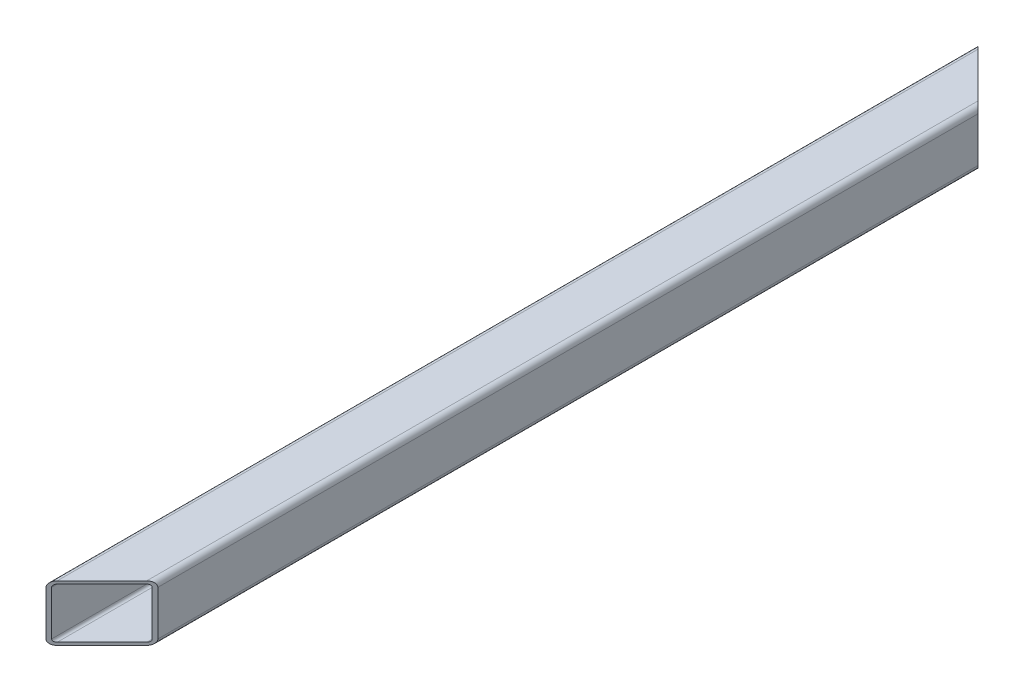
ISO-10303-21;
HEADER;
FILE_DESCRIPTION(('STEP AP214'),'2;1');
FILE_NAME('part.step','',(''),(''),'','','');
FILE_SCHEMA(('AUTOMOTIVE_DESIGN { 1 0 10303 214 1 1 1 1 }'));
ENDSEC;
DATA;
#1=APPLICATION_CONTEXT('core data for automotive mechanical design processes');
#2=APPLICATION_PROTOCOL_DEFINITION('international standard','automotive_design',2000,#1);
#3=PRODUCT_CONTEXT('',#1,'mechanical');
#4=PRODUCT('Part','Part','',(#3));
#5=PRODUCT_RELATED_PRODUCT_CATEGORY('part','',(#4));
#6=PRODUCT_DEFINITION_FORMATION('','',#4);
#7=PRODUCT_DEFINITION_CONTEXT('part definition',#1,'design');
#8=PRODUCT_DEFINITION('design','',#6,#7);
#9=PRODUCT_DEFINITION_SHAPE('','',#8);
#10=(LENGTH_UNIT() NAMED_UNIT(*) SI_UNIT(.MILLI.,.METRE.));
#11=(NAMED_UNIT(*) PLANE_ANGLE_UNIT() SI_UNIT($,.RADIAN.));
#12=(NAMED_UNIT(*) SI_UNIT($,.STERADIAN.) SOLID_ANGLE_UNIT());
#13=UNCERTAINTY_MEASURE_WITH_UNIT(LENGTH_MEASURE(1.E-05),#10,'distance_accuracy_value','');
#14=(GEOMETRIC_REPRESENTATION_CONTEXT(3) GLOBAL_UNCERTAINTY_ASSIGNED_CONTEXT((#13)) GLOBAL_UNIT_ASSIGNED_CONTEXT((#10,
#11,#12)) REPRESENTATION_CONTEXT('',''));
#15=CARTESIAN_POINT('',(0.,0.,0.));
#16=DIRECTION('',(0.,0.,1.));
#17=DIRECTION('',(1.,0.,0.));
#18=AXIS2_PLACEMENT_3D('',#15,#16,#17);
#19=CARTESIAN_POINT('',(6.,-54.,500.));
#20=DIRECTION('',(0.,0.,-1.));
#21=DIRECTION('',(-1.,0.,0.));
#22=AXIS2_PLACEMENT_3D('',#19,#20,#21);
#23=CYLINDRICAL_SURFACE('',#22,6.);
#24=CARTESIAN_POINT('',(6.,-54.,-494.));
#25=DIRECTION('',(0.707106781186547,0.,-0.707106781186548));
#26=DIRECTION('',(-0.707106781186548,0.,-0.707106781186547));
#27=AXIS2_PLACEMENT_3D('',#24,#25,#26);
#28=ELLIPSE('',#27,8.48528137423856,6.);
#29=CARTESIAN_POINT('',(6.00000000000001,-60.,-494.));
#30=VERTEX_POINT('',#29);
#31=CARTESIAN_POINT('',(0.,-54.,-500.));
#32=VERTEX_POINT('',#31);
#33=EDGE_CURVE('E154',#30,#32,#28,.T.);
#34=ORIENTED_EDGE('',*,*,#33,.F.);
#35=DIRECTION('',(0.,0.,-1.));
#36=VECTOR('',#35,1.);
#37=CARTESIAN_POINT('',(6.,-60.,500.));
#38=LINE('',#37,#36);
#39=CARTESIAN_POINT('',(6.,-60.,494.));
#40=VERTEX_POINT('',#39);
#41=EDGE_CURVE('E194',#40,#30,#38,.T.);
#42=ORIENTED_EDGE('',*,*,#41,.F.);
#43=CARTESIAN_POINT('',(6.,-54.,494.));
#44=DIRECTION('',(-0.707106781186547,0.,-0.707106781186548));
#45=DIRECTION('',(0.707106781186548,0.,-0.707106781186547));
#46=AXIS2_PLACEMENT_3D('',#43,#44,#45);
#47=ELLIPSE('',#46,8.48528137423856,6.);
#48=CARTESIAN_POINT('',(-2.22044604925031E-13,-54.,500.));
#49=VERTEX_POINT('',#48);
#50=EDGE_CURVE('E218',#40,#49,#47,.T.);
#51=ORIENTED_EDGE('',*,*,#50,.T.);
#52=DIRECTION('',(0.,0.,-1.));
#53=VECTOR('',#52,1.);
#54=CARTESIAN_POINT('',(0.,-54.,500.));
#55=LINE('',#54,#53);
#56=EDGE_CURVE('E175',#49,#32,#55,.T.);
#57=ORIENTED_EDGE('',*,*,#56,.T.);
#58=EDGE_LOOP('',(#34,#42,#51,#57));
#59=FACE_BOUND('',#58,.T.);
#60=ADVANCED_FACE('F36',(#59),#23,.T.);
#61=CARTESIAN_POINT('',(6.,-60.,500.));
#62=DIRECTION('',(0.,1.,0.));
#63=DIRECTION('',(0.,0.,1.));
#64=AXIS2_PLACEMENT_3D('',#61,#62,#63);
#65=PLANE('',#64);
#66=DIRECTION('',(-0.707106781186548,0.,-0.707106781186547));
#67=VECTOR('',#66,1.);
#68=CARTESIAN_POINT('',(503.,-60.,2.99999999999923));
#69=LINE('',#68,#67);
#70=CARTESIAN_POINT('',(54.,-60.,-446.));
#71=VERTEX_POINT('',#70);
#72=EDGE_CURVE('E263',#71,#30,#69,.T.);
#73=ORIENTED_EDGE('',*,*,#72,.F.);
#74=DIRECTION('',(0.,0.,-1.));
#75=VECTOR('',#74,1.);
#76=CARTESIAN_POINT('',(54.,-60.,500.));
#77=LINE('',#76,#75);
#78=CARTESIAN_POINT('',(54.,-60.,446.));
#79=VERTEX_POINT('',#78);
#80=EDGE_CURVE('E191',#79,#71,#77,.T.);
#81=ORIENTED_EDGE('',*,*,#80,.F.);
#82=DIRECTION('',(-0.707106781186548,0.,0.707106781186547));
#83=VECTOR('',#82,1.);
#84=CARTESIAN_POINT('',(2.9999999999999,-60.,497.));
#85=LINE('',#84,#83);
#86=EDGE_CURVE('E57',#79,#40,#85,.T.);
#87=ORIENTED_EDGE('',*,*,#86,.T.);
#88=ORIENTED_EDGE('',*,*,#41,.T.);
#89=EDGE_LOOP('',(#73,#81,#87,#88));
#90=FACE_BOUND('',#89,.T.);
#91=ADVANCED_FACE('F262',(#90),#65,.F.);
#92=CARTESIAN_POINT('',(54.,-54.,500.));
#93=DIRECTION('',(0.,0.,-1.));
#94=DIRECTION('',(-1.,0.,0.));
#95=AXIS2_PLACEMENT_3D('',#92,#93,#94);
#96=CYLINDRICAL_SURFACE('',#95,5.99999999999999);
#97=CARTESIAN_POINT('',(54.,-54.,-446.));
#98=DIRECTION('',(0.707106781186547,0.,-0.707106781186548));
#99=DIRECTION('',(-0.707106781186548,0.,-0.707106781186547));
#100=AXIS2_PLACEMENT_3D('',#97,#98,#99);
#101=ELLIPSE('',#100,8.48528137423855,5.99999999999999);
#102=CARTESIAN_POINT('',(59.9999999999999,-54.,-440.));
#103=VERTEX_POINT('',#102);
#104=EDGE_CURVE('E264',#103,#71,#101,.T.);
#105=ORIENTED_EDGE('',*,*,#104,.F.);
#106=DIRECTION('',(0.,0.,-1.));
#107=VECTOR('',#106,1.);
#108=CARTESIAN_POINT('',(60.,-54.,500.));
#109=LINE('',#108,#107);
#110=CARTESIAN_POINT('',(60.,-54.,440.));
#111=VERTEX_POINT('',#110);
#112=EDGE_CURVE('E188',#111,#103,#109,.T.);
#113=ORIENTED_EDGE('',*,*,#112,.F.);
#114=CARTESIAN_POINT('',(54.,-54.,446.));
#115=DIRECTION('',(-0.707106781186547,0.,-0.707106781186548));
#116=DIRECTION('',(0.707106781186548,0.,-0.707106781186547));
#117=AXIS2_PLACEMENT_3D('',#114,#115,#116);
#118=ELLIPSE('',#117,8.48528137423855,5.99999999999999);
#119=EDGE_CURVE('E249',#111,#79,#118,.T.);
#120=ORIENTED_EDGE('',*,*,#119,.T.);
#121=ORIENTED_EDGE('',*,*,#80,.T.);
#122=EDGE_LOOP('',(#105,#113,#120,#121));
#123=FACE_BOUND('',#122,.T.);
#124=ADVANCED_FACE('F259',(#123),#96,.T.);
#125=CARTESIAN_POINT('',(60.,-54.,500.));
#126=DIRECTION('',(-1.,0.,0.));
#127=DIRECTION('',(0.,0.,1.));
#128=AXIS2_PLACEMENT_3D('',#125,#126,#127);
#129=PLANE('',#128);
#130=DIRECTION('',(0.,-1.,0.));
#131=VECTOR('',#130,1.);
#132=CARTESIAN_POINT('',(59.9999999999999,0.,-440.));
#133=LINE('',#132,#131);
#134=CARTESIAN_POINT('',(60.,-6.,-440.));
#135=VERTEX_POINT('',#134);
#136=EDGE_CURVE('E304',#135,#103,#133,.T.);
#137=ORIENTED_EDGE('',*,*,#136,.F.);
#138=DIRECTION('',(0.,0.,-1.));
#139=VECTOR('',#138,1.);
#140=CARTESIAN_POINT('',(60.,-6.,500.));
#141=LINE('',#140,#139);
#142=CARTESIAN_POINT('',(60.,-6.,440.));
#143=VERTEX_POINT('',#142);
#144=EDGE_CURVE('E185',#143,#135,#141,.T.);
#145=ORIENTED_EDGE('',*,*,#144,.F.);
#146=DIRECTION('',(0.,-1.,0.));
#147=VECTOR('',#146,1.);
#148=CARTESIAN_POINT('',(59.9999999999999,0.,440.));
#149=LINE('',#148,#147);
#150=EDGE_CURVE('E271',#143,#111,#149,.T.);
#151=ORIENTED_EDGE('',*,*,#150,.T.);
#152=ORIENTED_EDGE('',*,*,#112,.T.);
#153=EDGE_LOOP('',(#137,#145,#151,#152));
#154=FACE_BOUND('',#153,.T.);
#155=ADVANCED_FACE('F310',(#154),#129,.F.);
#156=CARTESIAN_POINT('',(54.,-6.,500.));
#157=DIRECTION('',(0.,0.,-1.));
#158=DIRECTION('',(-1.,0.,0.));
#159=AXIS2_PLACEMENT_3D('',#156,#157,#158);
#160=CYLINDRICAL_SURFACE('',#159,5.99999999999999);
#161=CARTESIAN_POINT('',(54.,-6.,-446.));
#162=DIRECTION('',(0.707106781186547,0.,-0.707106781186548));
#163=DIRECTION('',(-0.707106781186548,0.,-0.707106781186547));
#164=AXIS2_PLACEMENT_3D('',#161,#162,#163);
#165=ELLIPSE('',#164,8.48528137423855,5.99999999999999);
#166=CARTESIAN_POINT('',(54.,0.,-446.));
#167=VERTEX_POINT('',#166);
#168=EDGE_CURVE('E168',#167,#135,#165,.T.);
#169=ORIENTED_EDGE('',*,*,#168,.F.);
#170=DIRECTION('',(0.,0.,-1.));
#171=VECTOR('',#170,1.);
#172=CARTESIAN_POINT('',(54.,0.,500.));
#173=LINE('',#172,#171);
#174=CARTESIAN_POINT('',(54.,0.,446.));
#175=VERTEX_POINT('',#174);
#176=EDGE_CURVE('E179',#175,#167,#173,.T.);
#177=ORIENTED_EDGE('',*,*,#176,.F.);
#178=CARTESIAN_POINT('',(54.,-6.,446.));
#179=DIRECTION('',(-0.707106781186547,0.,-0.707106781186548));
#180=DIRECTION('',(0.707106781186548,0.,-0.707106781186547));
#181=AXIS2_PLACEMENT_3D('',#178,#179,#180);
#182=ELLIPSE('',#181,8.48528137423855,5.99999999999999);
#183=EDGE_CURVE('E247',#175,#143,#182,.T.);
#184=ORIENTED_EDGE('',*,*,#183,.T.);
#185=ORIENTED_EDGE('',*,*,#144,.T.);
#186=EDGE_LOOP('',(#169,#177,#184,#185));
#187=FACE_BOUND('',#186,.T.);
#188=ADVANCED_FACE('F312',(#187),#160,.T.);
#189=CARTESIAN_POINT('',(6.,0.,500.));
#190=DIRECTION('',(0.,-1.,0.));
#191=DIRECTION('',(0.,0.,-1.));
#192=AXIS2_PLACEMENT_3D('',#189,#190,#191);
#193=PLANE('',#192);
#194=DIRECTION('',(0.707106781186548,0.,0.707106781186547));
#195=VECTOR('',#194,1.);
#196=CARTESIAN_POINT('',(-2.22044604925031E-13,0.,-500.));
#197=LINE('',#196,#195);
#198=CARTESIAN_POINT('',(6.,0.,-494.));
#199=VERTEX_POINT('',#198);
#200=EDGE_CURVE('E305',#199,#167,#197,.T.);
#201=ORIENTED_EDGE('',*,*,#200,.F.);
#202=DIRECTION('',(0.,0.,-1.));
#203=VECTOR('',#202,1.);
#204=CARTESIAN_POINT('',(6.,0.,500.));
#205=LINE('',#204,#203);
#206=CARTESIAN_POINT('',(6.,0.,494.));
#207=VERTEX_POINT('',#206);
#208=EDGE_CURVE('E167',#207,#199,#205,.T.);
#209=ORIENTED_EDGE('',*,*,#208,.F.);
#210=DIRECTION('',(0.707106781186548,0.,-0.707106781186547));
#211=VECTOR('',#210,1.);
#212=CARTESIAN_POINT('',(-2.22044604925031E-13,0.,500.));
#213=LINE('',#212,#211);
#214=EDGE_CURVE('E246',#207,#175,#213,.T.);
#215=ORIENTED_EDGE('',*,*,#214,.T.);
#216=ORIENTED_EDGE('',*,*,#176,.T.);
#217=EDGE_LOOP('',(#201,#209,#215,#216));
#218=FACE_BOUND('',#217,.T.);
#219=ADVANCED_FACE('F314',(#218),#193,.F.);
#220=CARTESIAN_POINT('',(6.,-6.,500.));
#221=DIRECTION('',(0.,0.,-1.));
#222=DIRECTION('',(-1.,0.,0.));
#223=AXIS2_PLACEMENT_3D('',#220,#221,#222);
#224=CYLINDRICAL_SURFACE('',#223,6.);
#225=CARTESIAN_POINT('',(6.,-6.,-494.));
#226=DIRECTION('',(0.707106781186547,0.,-0.707106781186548));
#227=DIRECTION('',(-0.707106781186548,0.,-0.707106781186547));
#228=AXIS2_PLACEMENT_3D('',#225,#226,#227);
#229=ELLIPSE('',#228,8.48528137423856,6.);
#230=CARTESIAN_POINT('',(-2.22044604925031E-13,-6.,-500.));
#231=VERTEX_POINT('',#230);
#232=EDGE_CURVE('E151',#231,#199,#229,.T.);
#233=ORIENTED_EDGE('',*,*,#232,.F.);
#234=DIRECTION('',(0.,0.,-1.));
#235=VECTOR('',#234,1.);
#236=CARTESIAN_POINT('',(0.,-6.,500.));
#237=LINE('',#236,#235);
#238=CARTESIAN_POINT('',(0.,-6.,500.));
#239=VERTEX_POINT('',#238);
#240=EDGE_CURVE('E164',#239,#231,#237,.T.);
#241=ORIENTED_EDGE('',*,*,#240,.F.);
#242=CARTESIAN_POINT('',(6.,-6.,494.));
#243=DIRECTION('',(-0.707106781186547,0.,-0.707106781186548));
#244=DIRECTION('',(0.707106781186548,0.,-0.707106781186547));
#245=AXIS2_PLACEMENT_3D('',#242,#243,#244);
#246=ELLIPSE('',#245,8.48528137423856,6.);
#247=EDGE_CURVE('E244',#239,#207,#246,.T.);
#248=ORIENTED_EDGE('',*,*,#247,.T.);
#249=ORIENTED_EDGE('',*,*,#208,.T.);
#250=EDGE_LOOP('',(#233,#241,#248,#249));
#251=FACE_BOUND('',#250,.T.);
#252=ADVANCED_FACE('F163',(#251),#224,.T.);
#253=CARTESIAN_POINT('',(6.,-54.,500.));
#254=DIRECTION('',(0.,0.,-1.));
#255=DIRECTION('',(-1.,0.,0.));
#256=AXIS2_PLACEMENT_3D('',#253,#254,#255);
#257=CYLINDRICAL_SURFACE('',#256,3.);
#258=DIRECTION('',(0.,0.,-1.));
#259=VECTOR('',#258,1.);
#260=CARTESIAN_POINT('',(6.,-57.,500.));
#261=LINE('',#260,#259);
#262=CARTESIAN_POINT('',(6.,-57.,494.));
#263=VERTEX_POINT('',#262);
#264=CARTESIAN_POINT('',(6.00000000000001,-57.,-494.));
#265=VERTEX_POINT('',#264);
#266=EDGE_CURVE('E159',#263,#265,#261,.T.);
#267=ORIENTED_EDGE('',*,*,#266,.T.);
#268=CARTESIAN_POINT('',(6.,-54.,-494.));
#269=DIRECTION('',(0.707106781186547,0.,-0.707106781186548));
#270=DIRECTION('',(-0.707106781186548,0.,-0.707106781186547));
#271=AXIS2_PLACEMENT_3D('',#268,#269,#270);
#272=ELLIPSE('',#271,4.24264068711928,3.);
#273=CARTESIAN_POINT('',(3.,-54.,-497.));
#274=VERTEX_POINT('',#273);
#275=EDGE_CURVE('E169',#265,#274,#272,.T.);
#276=ORIENTED_EDGE('',*,*,#275,.T.);
#277=DIRECTION('',(0.,0.,-1.));
#278=VECTOR('',#277,1.);
#279=CARTESIAN_POINT('',(3.,-54.,500.));
#280=LINE('',#279,#278);
#281=CARTESIAN_POINT('',(3.,-54.,497.));
#282=VERTEX_POINT('',#281);
#283=EDGE_CURVE('E210',#282,#274,#280,.T.);
#284=ORIENTED_EDGE('',*,*,#283,.F.);
#285=CARTESIAN_POINT('',(6.,-54.,494.));
#286=DIRECTION('',(-0.707106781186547,0.,-0.707106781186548));
#287=DIRECTION('',(0.707106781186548,0.,-0.707106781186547));
#288=AXIS2_PLACEMENT_3D('',#285,#286,#287);
#289=ELLIPSE('',#288,4.24264068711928,3.);
#290=EDGE_CURVE('E205',#263,#282,#289,.T.);
#291=ORIENTED_EDGE('',*,*,#290,.F.);
#292=EDGE_LOOP('',(#267,#276,#284,#291));
#293=FACE_BOUND('',#292,.T.);
#294=ADVANCED_FACE('F216',(#293),#257,.F.);
#295=CARTESIAN_POINT('',(6.,-57.,500.));
#296=DIRECTION('',(0.,1.,0.));
#297=DIRECTION('',(0.,0.,1.));
#298=AXIS2_PLACEMENT_3D('',#295,#296,#297);
#299=PLANE('',#298);
#300=DIRECTION('',(0.,0.,-1.));
#301=VECTOR('',#300,1.);
#302=CARTESIAN_POINT('',(54.,-57.,500.));
#303=LINE('',#302,#301);
#304=CARTESIAN_POINT('',(54.,-57.,446.));
#305=VERTEX_POINT('',#304);
#306=CARTESIAN_POINT('',(54.,-57.,-446.));
#307=VERTEX_POINT('',#306);
#308=EDGE_CURVE('E238',#305,#307,#303,.T.);
#309=ORIENTED_EDGE('',*,*,#308,.T.);
#310=DIRECTION('',(-0.707106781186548,0.,-0.707106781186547));
#311=VECTOR('',#310,1.);
#312=CARTESIAN_POINT('',(503.,-57.,2.99999999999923));
#313=LINE('',#312,#311);
#314=EDGE_CURVE('E294',#307,#265,#313,.T.);
#315=ORIENTED_EDGE('',*,*,#314,.T.);
#316=ORIENTED_EDGE('',*,*,#266,.F.);
#317=DIRECTION('',(-0.707106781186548,0.,0.707106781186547));
#318=VECTOR('',#317,1.);
#319=CARTESIAN_POINT('',(2.9999999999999,-57.,497.));
#320=LINE('',#319,#318);
#321=EDGE_CURVE('E251',#305,#263,#320,.T.);
#322=ORIENTED_EDGE('',*,*,#321,.F.);
#323=EDGE_LOOP('',(#309,#315,#316,#322));
#324=FACE_BOUND('',#323,.T.);
#325=ADVANCED_FACE('F286',(#324),#299,.T.);
#326=CARTESIAN_POINT('',(54.,-54.,500.));
#327=DIRECTION('',(0.,0.,-1.));
#328=DIRECTION('',(-1.,0.,0.));
#329=AXIS2_PLACEMENT_3D('',#326,#327,#328);
#330=CYLINDRICAL_SURFACE('',#329,2.99999999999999);
#331=DIRECTION('',(0.,0.,-1.));
#332=VECTOR('',#331,1.);
#333=CARTESIAN_POINT('',(57.,-54.,500.));
#334=LINE('',#333,#332);
#335=CARTESIAN_POINT('',(57.,-54.,443.));
#336=VERTEX_POINT('',#335);
#337=CARTESIAN_POINT('',(57.,-54.,-443.));
#338=VERTEX_POINT('',#337);
#339=EDGE_CURVE('E235',#336,#338,#334,.T.);
#340=ORIENTED_EDGE('',*,*,#339,.T.);
#341=CARTESIAN_POINT('',(54.,-54.,-446.));
#342=DIRECTION('',(0.707106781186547,0.,-0.707106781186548));
#343=DIRECTION('',(-0.707106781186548,0.,-0.707106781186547));
#344=AXIS2_PLACEMENT_3D('',#341,#342,#343);
#345=ELLIPSE('',#344,4.24264068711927,2.99999999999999);
#346=EDGE_CURVE('E292',#338,#307,#345,.T.);
#347=ORIENTED_EDGE('',*,*,#346,.T.);
#348=ORIENTED_EDGE('',*,*,#308,.F.);
#349=CARTESIAN_POINT('',(54.,-54.,446.));
#350=DIRECTION('',(-0.707106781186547,0.,-0.707106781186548));
#351=DIRECTION('',(0.707106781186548,0.,-0.707106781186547));
#352=AXIS2_PLACEMENT_3D('',#349,#350,#351);
#353=ELLIPSE('',#352,4.24264068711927,2.99999999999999);
#354=EDGE_CURVE('E282',#336,#305,#353,.T.);
#355=ORIENTED_EDGE('',*,*,#354,.F.);
#356=EDGE_LOOP('',(#340,#347,#348,#355));
#357=FACE_BOUND('',#356,.T.);
#358=ADVANCED_FACE('F290',(#357),#330,.F.);
#359=CARTESIAN_POINT('',(57.,-54.,500.));
#360=DIRECTION('',(-1.,0.,0.));
#361=DIRECTION('',(0.,-1.,0.));
#362=AXIS2_PLACEMENT_3D('',#359,#360,#361);
#363=PLANE('',#362);
#364=DIRECTION('',(0.,0.,-1.));
#365=VECTOR('',#364,1.);
#366=CARTESIAN_POINT('',(57.,-6.,500.));
#367=LINE('',#366,#365);
#368=CARTESIAN_POINT('',(57.,-6.,443.));
#369=VERTEX_POINT('',#368);
#370=CARTESIAN_POINT('',(57.,-6.,-443.));
#371=VERTEX_POINT('',#370);
#372=EDGE_CURVE('E232',#369,#371,#367,.T.);
#373=ORIENTED_EDGE('',*,*,#372,.T.);
#374=DIRECTION('',(0.,-1.,0.));
#375=VECTOR('',#374,1.);
#376=CARTESIAN_POINT('',(57.,-53.9999999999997,-443.));
#377=LINE('',#376,#375);
#378=EDGE_CURVE('E295',#371,#338,#377,.T.);
#379=ORIENTED_EDGE('',*,*,#378,.T.);
#380=ORIENTED_EDGE('',*,*,#339,.F.);
#381=DIRECTION('',(0.,-1.,0.));
#382=VECTOR('',#381,1.);
#383=CARTESIAN_POINT('',(57.,-54.,443.));
#384=LINE('',#383,#382);
#385=EDGE_CURVE('E279',#369,#336,#384,.T.);
#386=ORIENTED_EDGE('',*,*,#385,.F.);
#387=EDGE_LOOP('',(#373,#379,#380,#386));
#388=FACE_BOUND('',#387,.T.);
#389=ADVANCED_FACE('F326',(#388),#363,.T.);
#390=CARTESIAN_POINT('',(54.,-6.,500.));
#391=DIRECTION('',(0.,0.,-1.));
#392=DIRECTION('',(-1.,0.,0.));
#393=AXIS2_PLACEMENT_3D('',#390,#391,#392);
#394=CYLINDRICAL_SURFACE('',#393,3.);
#395=DIRECTION('',(0.,0.,-1.));
#396=VECTOR('',#395,1.);
#397=CARTESIAN_POINT('',(54.,-3.,500.));
#398=LINE('',#397,#396);
#399=CARTESIAN_POINT('',(54.,-3.,446.));
#400=VERTEX_POINT('',#399);
#401=CARTESIAN_POINT('',(54.,-3.,-446.));
#402=VERTEX_POINT('',#401);
#403=EDGE_CURVE('E229',#400,#402,#398,.T.);
#404=ORIENTED_EDGE('',*,*,#403,.T.);
#405=CARTESIAN_POINT('',(54.,-6.,-446.));
#406=DIRECTION('',(0.707106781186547,0.,-0.707106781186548));
#407=DIRECTION('',(-0.707106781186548,0.,-0.707106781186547));
#408=AXIS2_PLACEMENT_3D('',#405,#406,#407);
#409=ELLIPSE('',#408,4.24264068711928,3.);
#410=EDGE_CURVE('E298',#402,#371,#409,.T.);
#411=ORIENTED_EDGE('',*,*,#410,.T.);
#412=ORIENTED_EDGE('',*,*,#372,.F.);
#413=CARTESIAN_POINT('',(54.,-6.,446.));
#414=DIRECTION('',(-0.707106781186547,0.,-0.707106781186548));
#415=DIRECTION('',(0.707106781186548,0.,-0.707106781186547));
#416=AXIS2_PLACEMENT_3D('',#413,#414,#415);
#417=ELLIPSE('',#416,4.24264068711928,3.);
#418=EDGE_CURVE('E276',#400,#369,#417,.T.);
#419=ORIENTED_EDGE('',*,*,#418,.F.);
#420=EDGE_LOOP('',(#404,#411,#412,#419));
#421=FACE_BOUND('',#420,.T.);
#422=ADVANCED_FACE('F323',(#421),#394,.F.);
#423=CARTESIAN_POINT('',(6.,-3.,500.));
#424=DIRECTION('',(0.,-1.,0.));
#425=DIRECTION('',(0.,0.,-1.));
#426=AXIS2_PLACEMENT_3D('',#423,#424,#425);
#427=PLANE('',#426);
#428=DIRECTION('',(0.,0.,-1.));
#429=VECTOR('',#428,1.);
#430=CARTESIAN_POINT('',(6.,-3.,500.));
#431=LINE('',#430,#429);
#432=CARTESIAN_POINT('',(6.,-3.,494.));
#433=VERTEX_POINT('',#432);
#434=CARTESIAN_POINT('',(6.,-3.,-494.));
#435=VERTEX_POINT('',#434);
#436=EDGE_CURVE('E220',#433,#435,#431,.T.);
#437=ORIENTED_EDGE('',*,*,#436,.T.);
#438=DIRECTION('',(0.707106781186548,0.,0.707106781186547));
#439=VECTOR('',#438,1.);
#440=CARTESIAN_POINT('',(503.,-3.,2.99999999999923));
#441=LINE('',#440,#439);
#442=EDGE_CURVE('E318',#435,#402,#441,.T.);
#443=ORIENTED_EDGE('',*,*,#442,.T.);
#444=ORIENTED_EDGE('',*,*,#403,.F.);
#445=DIRECTION('',(0.707106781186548,0.,-0.707106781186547));
#446=VECTOR('',#445,1.);
#447=CARTESIAN_POINT('',(2.9999999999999,-3.,497.));
#448=LINE('',#447,#446);
#449=EDGE_CURVE('E274',#433,#400,#448,.T.);
#450=ORIENTED_EDGE('',*,*,#449,.F.);
#451=EDGE_LOOP('',(#437,#443,#444,#450));
#452=FACE_BOUND('',#451,.T.);
#453=ADVANCED_FACE('F328',(#452),#427,.T.);
#454=CARTESIAN_POINT('',(6.,-6.,500.));
#455=DIRECTION('',(0.,0.,-1.));
#456=DIRECTION('',(-1.,0.,0.));
#457=AXIS2_PLACEMENT_3D('',#454,#455,#456);
#458=CYLINDRICAL_SURFACE('',#457,3.);
#459=DIRECTION('',(0.,0.,-1.));
#460=VECTOR('',#459,1.);
#461=CARTESIAN_POINT('',(3.,-6.,500.));
#462=LINE('',#461,#460);
#463=CARTESIAN_POINT('',(3.,-6.,497.));
#464=VERTEX_POINT('',#463);
#465=CARTESIAN_POINT('',(3.,-6.,-497.));
#466=VERTEX_POINT('',#465);
#467=EDGE_CURVE('E212',#464,#466,#462,.T.);
#468=ORIENTED_EDGE('',*,*,#467,.T.);
#469=CARTESIAN_POINT('',(6.,-6.,-494.));
#470=DIRECTION('',(0.707106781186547,0.,-0.707106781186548));
#471=DIRECTION('',(-0.707106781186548,0.,-0.707106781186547));
#472=AXIS2_PLACEMENT_3D('',#469,#470,#471);
#473=ELLIPSE('',#472,4.24264068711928,3.);
#474=EDGE_CURVE('E50',#466,#435,#473,.T.);
#475=ORIENTED_EDGE('',*,*,#474,.T.);
#476=ORIENTED_EDGE('',*,*,#436,.F.);
#477=CARTESIAN_POINT('',(6.,-6.,494.));
#478=DIRECTION('',(-0.707106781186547,0.,-0.707106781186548));
#479=DIRECTION('',(0.707106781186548,0.,-0.707106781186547));
#480=AXIS2_PLACEMENT_3D('',#477,#478,#479);
#481=ELLIPSE('',#480,4.24264068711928,3.);
#482=EDGE_CURVE('E204',#464,#433,#481,.T.);
#483=ORIENTED_EDGE('',*,*,#482,.F.);
#484=EDGE_LOOP('',(#468,#475,#476,#483));
#485=FACE_BOUND('',#484,.T.);
#486=ADVANCED_FACE('F331',(#485),#458,.F.);
#487=CARTESIAN_POINT('',(3.,-54.,500.));
#488=DIRECTION('',(1.,0.,0.));
#489=DIRECTION('',(0.,0.,-1.));
#490=AXIS2_PLACEMENT_3D('',#487,#488,#489);
#491=PLANE('',#490);
#492=ORIENTED_EDGE('',*,*,#283,.T.);
#493=DIRECTION('',(0.,1.,0.));
#494=VECTOR('',#493,1.);
#495=CARTESIAN_POINT('',(3.,-54.,-497.));
#496=LINE('',#495,#494);
#497=EDGE_CURVE('E11',#274,#466,#496,.T.);
#498=ORIENTED_EDGE('',*,*,#497,.T.);
#499=ORIENTED_EDGE('',*,*,#467,.F.);
#500=DIRECTION('',(0.,1.,0.));
#501=VECTOR('',#500,1.);
#502=CARTESIAN_POINT('',(3.,-54.,497.));
#503=LINE('',#502,#501);
#504=EDGE_CURVE('E43',#282,#464,#503,.T.);
#505=ORIENTED_EDGE('',*,*,#504,.F.);
#506=EDGE_LOOP('',(#492,#498,#499,#505));
#507=FACE_BOUND('',#506,.T.);
#508=ADVANCED_FACE('F209',(#507),#491,.T.);
#509=CARTESIAN_POINT('',(0.,-54.,500.));
#510=DIRECTION('',(1.,0.,0.));
#511=DIRECTION('',(0.,0.,-1.));
#512=AXIS2_PLACEMENT_3D('',#509,#510,#511);
#513=PLANE('',#512);
#514=DIRECTION('',(0.,-1.,0.));
#515=VECTOR('',#514,1.);
#516=CARTESIAN_POINT('',(0.,-54.,-500.));
#517=LINE('',#516,#515);
#518=EDGE_CURVE('E148',#231,#32,#517,.T.);
#519=ORIENTED_EDGE('',*,*,#518,.T.);
#520=ORIENTED_EDGE('',*,*,#56,.F.);
#521=DIRECTION('',(0.,-1.,0.));
#522=VECTOR('',#521,1.);
#523=CARTESIAN_POINT('',(0.,-54.,500.));
#524=LINE('',#523,#522);
#525=EDGE_CURVE('E158',#239,#49,#524,.T.);
#526=ORIENTED_EDGE('',*,*,#525,.F.);
#527=ORIENTED_EDGE('',*,*,#240,.T.);
#528=EDGE_LOOP('',(#519,#520,#526,#527));
#529=FACE_BOUND('',#528,.T.);
#530=ADVANCED_FACE('F171',(#529),#513,.F.);
#531=CARTESIAN_POINT('',(-2.22044604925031E-13,0.,500.));
#532=DIRECTION('',(-0.707106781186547,0.,-0.707106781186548));
#533=DIRECTION('',(-0.707106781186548,0.,0.707106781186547));
#534=AXIS2_PLACEMENT_3D('',#531,#532,#533);
#535=PLANE('',#534);
#536=ORIENTED_EDGE('',*,*,#321,.T.);
#537=ORIENTED_EDGE('',*,*,#290,.T.);
#538=ORIENTED_EDGE('',*,*,#504,.T.);
#539=ORIENTED_EDGE('',*,*,#482,.T.);
#540=ORIENTED_EDGE('',*,*,#449,.T.);
#541=ORIENTED_EDGE('',*,*,#418,.T.);
#542=ORIENTED_EDGE('',*,*,#385,.T.);
#543=ORIENTED_EDGE('',*,*,#354,.T.);
#544=EDGE_LOOP('',(#536,#537,#538,#539,#540,#541,#542,#543));
#545=FACE_BOUND('',#544,.T.);
#546=ORIENTED_EDGE('',*,*,#50,.F.);
#547=ORIENTED_EDGE('',*,*,#86,.F.);
#548=ORIENTED_EDGE('',*,*,#119,.F.);
#549=ORIENTED_EDGE('',*,*,#150,.F.);
#550=ORIENTED_EDGE('',*,*,#183,.F.);
#551=ORIENTED_EDGE('',*,*,#214,.F.);
#552=ORIENTED_EDGE('',*,*,#247,.F.);
#553=ORIENTED_EDGE('',*,*,#525,.T.);
#554=EDGE_LOOP('',(#546,#547,#548,#549,#550,#551,#552,#553));
#555=FACE_BOUND('',#554,.T.);
#556=ADVANCED_FACE('F200',(#545,#555),#535,.F.);
#557=CARTESIAN_POINT('',(-2.22044604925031E-13,0.,-500.));
#558=DIRECTION('',(0.707106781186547,0.,-0.707106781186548));
#559=DIRECTION('',(-0.707106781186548,0.,-0.707106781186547));
#560=AXIS2_PLACEMENT_3D('',#557,#558,#559);
#561=PLANE('',#560);
#562=ORIENTED_EDGE('',*,*,#275,.F.);
#563=ORIENTED_EDGE('',*,*,#314,.F.);
#564=ORIENTED_EDGE('',*,*,#346,.F.);
#565=ORIENTED_EDGE('',*,*,#378,.F.);
#566=ORIENTED_EDGE('',*,*,#410,.F.);
#567=ORIENTED_EDGE('',*,*,#442,.F.);
#568=ORIENTED_EDGE('',*,*,#474,.F.);
#569=ORIENTED_EDGE('',*,*,#497,.F.);
#570=EDGE_LOOP('',(#562,#563,#564,#565,#566,#567,#568,#569));
#571=FACE_BOUND('',#570,.T.);
#572=ORIENTED_EDGE('',*,*,#72,.T.);
#573=ORIENTED_EDGE('',*,*,#33,.T.);
#574=ORIENTED_EDGE('',*,*,#518,.F.);
#575=ORIENTED_EDGE('',*,*,#232,.T.);
#576=ORIENTED_EDGE('',*,*,#200,.T.);
#577=ORIENTED_EDGE('',*,*,#168,.T.);
#578=ORIENTED_EDGE('',*,*,#136,.T.);
#579=ORIENTED_EDGE('',*,*,#104,.T.);
#580=EDGE_LOOP('',(#572,#573,#574,#575,#576,#577,#578,#579));
#581=FACE_BOUND('',#580,.T.);
#582=ADVANCED_FACE('F150',(#571,#581),#561,.T.);
#583=CLOSED_SHELL('',(#60,#91,#124,#155,#188,#219,#252,#294,#325,#358,#389,#422,#453,#486,#508,
#530,#556,#582));
#584=MANIFOLD_SOLID_BREP('B2',#583);
#585=ADVANCED_BREP_SHAPE_REPRESENTATION('',(#18,#584),#14);
#586=SHAPE_DEFINITION_REPRESENTATION(#9,#585);
ENDSEC;
END-ISO-10303-21;
